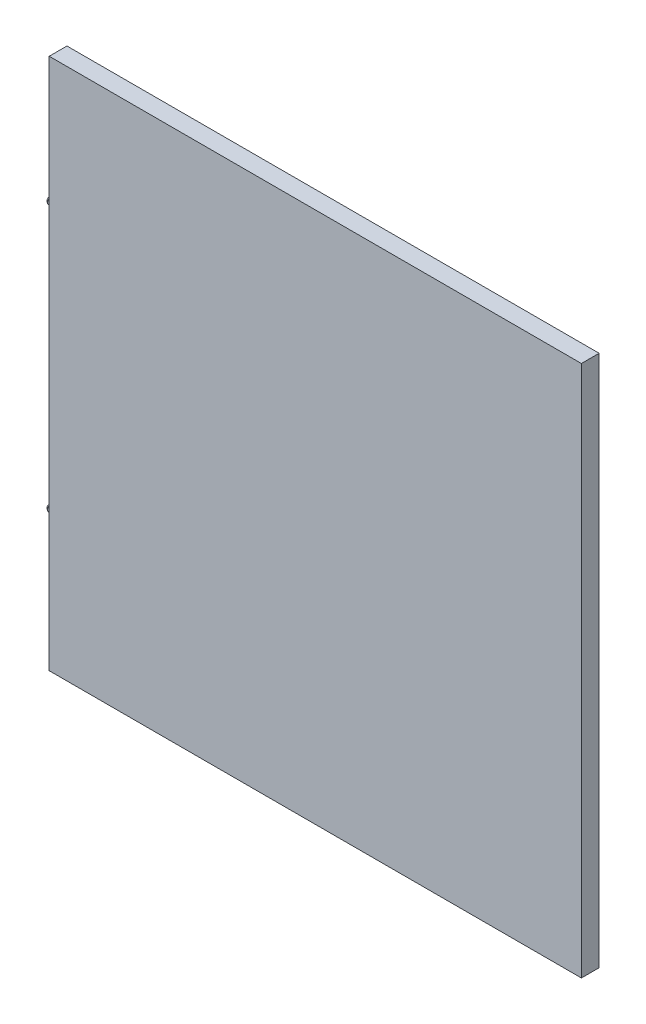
from build123d import *
from OCP.BRepFilletAPI import BRepFilletAPI_MakeChamfer

# Parameters (mm, degrees)
SKETCH1_W                     = 300
SKETCH1_H                     = 300
BOSS_EXTRUDE1_DEPTH           = 10
SKETCH2_R                     = 2
CUT_EXTRUDE1_DEPTH            = 5
SKETCH3_R                     = 2
BOSS_EXTRUDE2_DEPTH           = 5
BOSS_EXTRUDE2_DRAFT           = 1
BOSS_EXTRUDE2_PROFILE_2_DEPTH = 5
BOSS_EXTRUDE2_PROFILE_2_DRAFT = 1
CHAMFER1_SIZE                 = 1
CHAMFER1_SIZE2                = 0.583316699


with BuildPart() as part:
    # Sketch1 → Boss-Extrude1 (new body)
    with BuildSketch(Plane.XY):
        Rectangle(SKETCH1_W, SKETCH1_H)
    extrude(amount=BOSS_EXTRUDE1_DEPTH)

    # Sketch2 → Cut-Extrude1 (cut)
    with BuildSketch(Plane(origin=(0, 0, 0), x_dir=(-1, 0, 0), z_dir=(0, 0, -1))):
        with Locations((-144, 75)):
            Circle(SKETCH2_R)
        with Locations(Location((-144, -75, 0), (0, 0, 180))):
            Circle(SKETCH2_R)
    extrude(amount=-CUT_EXTRUDE1_DEPTH, mode=Mode.SUBTRACT)


with BuildPart() as boss_extrude2_tool:
    # Sketch3 → Boss-Extrude2 (with draft: the straight prism first)
    with BuildSketch(Plane.ZY.offset(150)):
        with Locations((5, 75)):
            Circle(SKETCH3_R)
    extrude(amount=BOSS_EXTRUDE2_DEPTH)
    # Boss-Extrude2: the draft: its side faces are tilted about the plane it starts from
    boss_extrude2_sides = [boss_extrude2_tool.faces().sort_by_distance(p)[0] for p in [
        (-152.5, 75, 3),
    ]]
    draft(boss_extrude2_sides, Plane.ZY.offset(150), BOSS_EXTRUDE2_DRAFT)


with BuildPart() as part_1:
    add(part.part)

    # Boss-Extrude2: add boss_extrude2_tool
    add(boss_extrude2_tool.part)


with BuildPart() as boss_extrude2_profile_2_tool:
    # Sketch3 → Boss-Extrude2 profile 2 (with draft: the straight prism first)
    with BuildSketch(Plane.ZY.offset(150)):
        with Locations((5, -75)):
            Circle(SKETCH3_R)
    extrude(amount=BOSS_EXTRUDE2_PROFILE_2_DEPTH)
    # Boss-Extrude2 profile 2: the draft: its side faces are tilted about the plane it starts from
    boss_extrude2_profile_2_sides = [boss_extrude2_profile_2_tool.faces().sort_by_distance(p)[0] for p in [
        (-152.5, -75, 3),
    ]]
    draft(boss_extrude2_profile_2_sides, Plane.ZY.offset(150), BOSS_EXTRUDE2_PROFILE_2_DRAFT)


with BuildPart() as part_2:
    add(part_1.part)

    # Boss-Extrude2 profile 2: add boss_extrude2_profile_2_tool
    add(boss_extrude2_profile_2_tool.part)

    # Chamfer1: one chamfer whose edges measure the first distance from different faces: ONE call of the kernel's chamfer builder (chamfer() names one face for all edges)
    chamfer1_edges_1 = [part_2.edges().sort_by_distance(p)[0] for p in [
        (-155, 75, 3.087275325),
    ]]
    chamfer1_side_1 = [part_2.faces().sort_by_distance(p)[0] for p in [
        (-152.5, 75, 3.043637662),
    ]]
    chamfer1_edges_2 = [part_2.edges().sort_by_distance(p)[0] for p in [
        (-155, -75, 3.087275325),
    ]]
    chamfer1_side_2 = [part_2.faces().sort_by_distance(p)[0] for p in [
        (-152.5, -75, 3.043637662),
    ]]
    chamfer1 = BRepFilletAPI_MakeChamfer(part_2.part.solid().wrapped)
    for e in chamfer1_edges_1:
        chamfer1.Add(CHAMFER1_SIZE, CHAMFER1_SIZE2, e.wrapped, chamfer1_side_1[0].wrapped)  # the first distance lies on this face
    for e in chamfer1_edges_2:
        chamfer1.Add(CHAMFER1_SIZE, CHAMFER1_SIZE2, e.wrapped, chamfer1_side_2[0].wrapped)  # the first distance lies on this face
    add(Compound.cast(chamfer1.Shape()), mode=Mode.REPLACE)


solid = part_2.part
